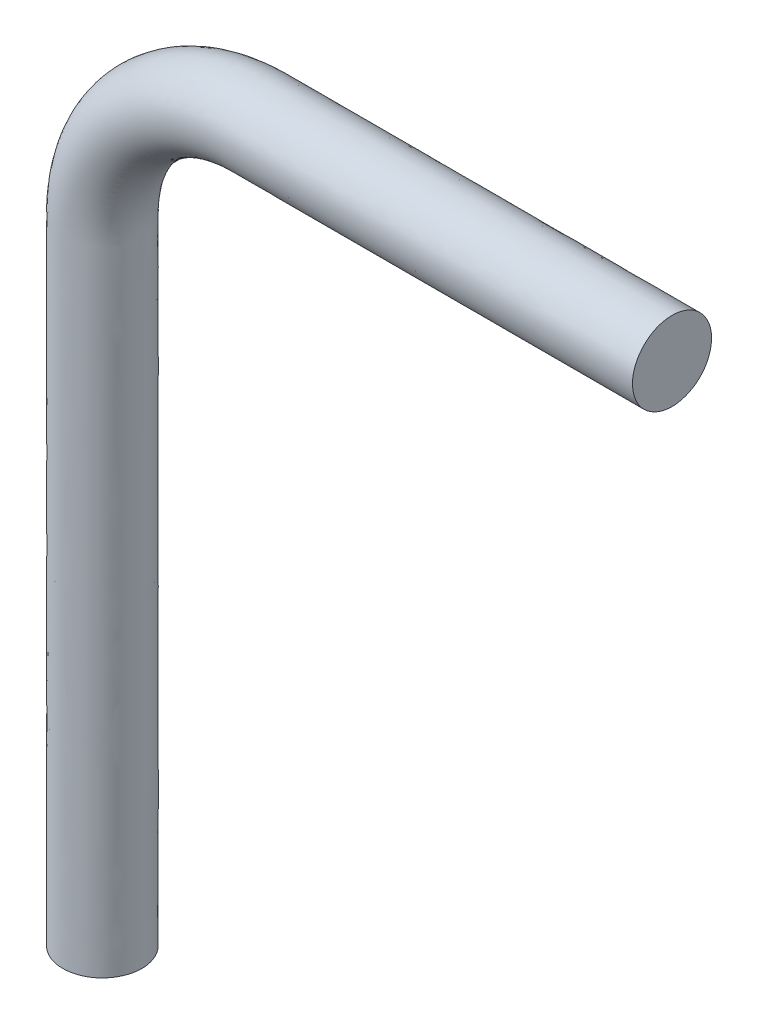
ISO-10303-21;
HEADER;
FILE_DESCRIPTION(('STEP AP214'),'2;1');
FILE_NAME('part.step','',(''),(''),'','','');
FILE_SCHEMA(('AUTOMOTIVE_DESIGN { 1 0 10303 214 1 1 1 1 }'));
ENDSEC;
DATA;
#1=APPLICATION_CONTEXT('core data for automotive mechanical design processes');
#2=APPLICATION_PROTOCOL_DEFINITION('international standard','automotive_design',2000,#1);
#3=PRODUCT_CONTEXT('',#1,'mechanical');
#4=PRODUCT('Part','Part','',(#3));
#5=PRODUCT_RELATED_PRODUCT_CATEGORY('part','',(#4));
#6=PRODUCT_DEFINITION_FORMATION('','',#4);
#7=PRODUCT_DEFINITION_CONTEXT('part definition',#1,'design');
#8=PRODUCT_DEFINITION('design','',#6,#7);
#9=PRODUCT_DEFINITION_SHAPE('','',#8);
#10=(LENGTH_UNIT() NAMED_UNIT(*) SI_UNIT(.MILLI.,.METRE.));
#11=(NAMED_UNIT(*) PLANE_ANGLE_UNIT() SI_UNIT($,.RADIAN.));
#12=(NAMED_UNIT(*) SI_UNIT($,.STERADIAN.) SOLID_ANGLE_UNIT());
#13=UNCERTAINTY_MEASURE_WITH_UNIT(LENGTH_MEASURE(1.E-05),#10,'distance_accuracy_value','');
#14=(GEOMETRIC_REPRESENTATION_CONTEXT(3) GLOBAL_UNCERTAINTY_ASSIGNED_CONTEXT((#13)) GLOBAL_UNIT_ASSIGNED_CONTEXT((#10,
#11,#12)) REPRESENTATION_CONTEXT('',''));
#15=CARTESIAN_POINT('',(0.,0.,0.));
#16=DIRECTION('',(0.,0.,1.));
#17=DIRECTION('',(1.,0.,0.));
#18=AXIS2_PLACEMENT_3D('',#15,#16,#17);
#19=CARTESIAN_POINT('',(0.,-126.867609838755,0.));
#20=DIRECTION('',(1.,0.,0.));
#21=DIRECTION('',(0.,0.,-1.));
#22=AXIS2_PLACEMENT_3D('',#19,#20,#21);
#23=PLANE('',#22);
#24=CARTESIAN_POINT('',(0.,-131.8375,0.));
#25=CARTESIAN_POINT('',(0.,-131.8375,0.741304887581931));
#26=CARTESIAN_POINT('',(0.,-131.123512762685,2.22391466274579));
#27=CARTESIAN_POINT('',(0.,-128.717040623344,2.77317622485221));
#28=CARTESIAN_POINT('',(0.,-126.787199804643,1.23417952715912));
#29=CARTESIAN_POINT('',(0.,-126.787199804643,-1.23417952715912));
#30=CARTESIAN_POINT('',(0.,-128.717040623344,-2.77317622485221));
#31=CARTESIAN_POINT('',(0.,-131.123512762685,-2.22391466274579));
#32=CARTESIAN_POINT('',(0.,-131.8375,-0.741304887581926));
#33=CARTESIAN_POINT('',(0.,-131.8375,0.));
#34=B_SPLINE_CURVE_WITH_KNOTS('',3,(#24,#25,#26,#27,#28,#29,#30,#31,#32,#33),.UNSPECIFIED.,.T.,
.F.,(4,1,1,1,1,1,1,4),(0.,0.142857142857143,0.285714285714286,0.428571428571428,
0.571428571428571,0.714285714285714,0.857142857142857,1.),.UNSPECIFIED.);
#35=CARTESIAN_POINT('',(0.,-131.8375,0.));
#36=VERTEX_POINT('',#35);
#37=EDGE_CURVE('E24',#36,#36,#34,.T.);
#38=ORIENTED_EDGE('',*,*,#37,.F.);
#39=EDGE_LOOP('',(#38));
#40=FACE_BOUND('',#39,.T.);
#41=ADVANCED_FACE('F14',(#40),#23,.T.);
#42=CARTESIAN_POINT('',(-38.3023901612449,-179.1,0.));
#43=DIRECTION('',(0.,1.,0.));
#44=DIRECTION('',(0.,0.,1.));
#45=AXIS2_PLACEMENT_3D('',#42,#43,#44);
#46=PLANE('',#45);
#47=CARTESIAN_POINT('',(-33.3325,-179.1,0.));
#48=CARTESIAN_POINT('',(-33.3325,-179.1,0.741304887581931));
#49=CARTESIAN_POINT('',(-34.0464872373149,-179.1,2.22391466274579));
#50=CARTESIAN_POINT('',(-36.4529593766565,-179.1,2.77317622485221));
#51=CARTESIAN_POINT('',(-38.3828001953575,-179.1,1.23417952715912));
#52=CARTESIAN_POINT('',(-38.3828001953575,-179.1,-1.23417952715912));
#53=CARTESIAN_POINT('',(-36.4529593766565,-179.1,-2.77317622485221));
#54=CARTESIAN_POINT('',(-34.0464872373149,-179.1,-2.22391466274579));
#55=CARTESIAN_POINT('',(-33.3325,-179.1,-0.741304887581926));
#56=CARTESIAN_POINT('',(-33.3325,-179.1,0.));
#57=B_SPLINE_CURVE_WITH_KNOTS('',3,(#47,#48,#49,#50,#51,#52,#53,#54,#55,#56),.UNSPECIFIED.,.T.,
.F.,(4,1,1,1,1,1,1,4),(0.,0.142857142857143,0.285714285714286,0.428571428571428,
0.571428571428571,0.714285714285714,0.857142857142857,1.),.UNSPECIFIED.);
#58=CARTESIAN_POINT('',(-33.3325,-179.1,0.));
#59=VERTEX_POINT('',#58);
#60=EDGE_CURVE('E10',#59,#59,#57,.F.);
#61=ORIENTED_EDGE('',*,*,#60,.F.);
#62=EDGE_LOOP('',(#61));
#63=FACE_BOUND('',#62,.T.);
#64=ADVANCED_FACE('F16',(#63),#46,.F.);
#65=CARTESIAN_POINT('',(0.,-131.8375,0.));
#66=CARTESIAN_POINT('',(-8.62333333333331,-131.8375,0.));
#67=CARTESIAN_POINT('',(-17.2466666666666,-131.8375,0.));
#68=CARTESIAN_POINT('',(-25.87,-131.8375,0.));
#69=CARTESIAN_POINT('',(-26.8424136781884,-131.8375,0.));
#70=CARTESIAN_POINT('',(-28.802116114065,-132.225905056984,0.));
#71=CARTESIAN_POINT('',(-31.2836237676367,-133.886376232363,0.));
#72=CARTESIAN_POINT('',(-32.9440949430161,-136.367883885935,0.));
#73=CARTESIAN_POINT('',(-33.3325,-138.327586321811,0.));
#74=CARTESIAN_POINT('',(-33.3325,-139.3,0.));
#75=CARTESIAN_POINT('',(-33.3325,-152.566666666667,0.));
#76=CARTESIAN_POINT('',(-33.3325,-165.833333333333,0.));
#77=CARTESIAN_POINT('',(-33.3325,-179.1,0.));
#78=CARTESIAN_POINT('',(0.,-131.8375,0.741304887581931));
#79=CARTESIAN_POINT('',(-8.62333333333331,-131.8375,0.741304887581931));
#80=CARTESIAN_POINT('',(-17.2466666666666,-131.8375,0.741304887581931));
#81=CARTESIAN_POINT('',(-25.87,-131.8375,0.741304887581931));
#82=CARTESIAN_POINT('',(-26.8424136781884,-131.8375,0.741304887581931));
#83=CARTESIAN_POINT('',(-28.802116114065,-132.225905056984,0.741304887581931));
#84=CARTESIAN_POINT('',(-31.2836237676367,-133.886376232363,0.741304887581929));
#85=CARTESIAN_POINT('',(-32.9440949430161,-136.367883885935,0.741304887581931));
#86=CARTESIAN_POINT('',(-33.3325,-138.327586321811,0.741304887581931));
#87=CARTESIAN_POINT('',(-33.3325,-139.3,0.741304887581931));
#88=CARTESIAN_POINT('',(-33.3325,-152.566666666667,0.741304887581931));
#89=CARTESIAN_POINT('',(-33.3325,-165.833333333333,0.741304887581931));
#90=CARTESIAN_POINT('',(-33.3325,-179.1,0.741304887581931));
#91=CARTESIAN_POINT('',(0.,-131.123512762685,2.22391466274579));
#92=CARTESIAN_POINT('',(-8.62333333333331,-131.123512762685,2.22391466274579));
#93=CARTESIAN_POINT('',(-17.2466666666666,-131.123512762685,2.22391466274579));
#94=CARTESIAN_POINT('',(-25.87,-131.123512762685,2.22391466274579));
#95=CARTESIAN_POINT('',(-26.9370942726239,-131.123512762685,2.22391466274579));
#96=CARTESIAN_POINT('',(-29.0818883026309,-131.549137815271,2.22391466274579));
#97=CARTESIAN_POINT('',(-31.8017867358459,-133.368213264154,2.22391466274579));
#98=CARTESIAN_POINT('',(-33.620862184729,-136.088111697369,2.22391466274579));
#99=CARTESIAN_POINT('',(-34.0464872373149,-138.232905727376,2.22391466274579));
#100=CARTESIAN_POINT('',(-34.0464872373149,-139.3,2.22391466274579));
#101=CARTESIAN_POINT('',(-34.0464872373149,-152.566666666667,2.22391466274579));
#102=CARTESIAN_POINT('',(-34.0464872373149,-165.833333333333,2.22391466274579));
#103=CARTESIAN_POINT('',(-34.0464872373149,-179.1,2.22391466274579));
#104=CARTESIAN_POINT('',(0.,-128.717040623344,2.77317622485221));
#105=CARTESIAN_POINT('',(-8.62333333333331,-128.717040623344,2.77317622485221));
#106=CARTESIAN_POINT('',(-17.2466666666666,-128.717040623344,2.77317622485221));
#107=CARTESIAN_POINT('',(-25.87,-128.717040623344,2.77317622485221));
#108=CARTESIAN_POINT('',(-27.2562123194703,-128.717040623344,2.77317622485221));
#109=CARTESIAN_POINT('',(-30.0248519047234,-129.268114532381,2.77317622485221));
#110=CARTESIAN_POINT('',(-33.5482391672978,-131.621760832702,2.77317622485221));
#111=CARTESIAN_POINT('',(-35.9018854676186,-135.145148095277,2.77317622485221));
#112=CARTESIAN_POINT('',(-36.4529593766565,-137.91378768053,2.77317622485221));
#113=CARTESIAN_POINT('',(-36.4529593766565,-139.3,2.77317622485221));
#114=CARTESIAN_POINT('',(-36.4529593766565,-152.566666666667,2.77317622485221));
#115=CARTESIAN_POINT('',(-36.4529593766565,-165.833333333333,2.77317622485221));
#116=CARTESIAN_POINT('',(-36.4529593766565,-179.1,2.77317622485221));
#117=CARTESIAN_POINT('',(0.,-126.787199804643,1.23417952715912));
#118=CARTESIAN_POINT('',(-8.62333333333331,-126.787199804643,1.23417952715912));
#119=CARTESIAN_POINT('',(-17.2466666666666,-126.787199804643,1.23417952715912));
#120=CARTESIAN_POINT('',(-25.87,-126.787199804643,1.23417952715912));
#121=CARTESIAN_POINT('',(-27.5121251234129,-126.787199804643,1.23417952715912));
#122=CARTESIAN_POINT('',(-30.7810500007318,-127.438875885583,1.23417952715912));
#123=CARTESIAN_POINT('',(-34.9487852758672,-130.221214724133,1.23417952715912));
#124=CARTESIAN_POINT('',(-37.7311241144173,-134.388949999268,1.23417952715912));
#125=CARTESIAN_POINT('',(-38.3828001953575,-137.657874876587,1.23417952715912));
#126=CARTESIAN_POINT('',(-38.3828001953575,-139.3,1.23417952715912));
#127=CARTESIAN_POINT('',(-38.3828001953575,-152.566666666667,1.23417952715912));
#128=CARTESIAN_POINT('',(-38.3828001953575,-165.833333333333,1.23417952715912));
#129=CARTESIAN_POINT('',(-38.3828001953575,-179.1,1.23417952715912));
#130=CARTESIAN_POINT('',(0.,-126.787199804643,-1.23417952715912));
#131=CARTESIAN_POINT('',(-8.62333333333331,-126.787199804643,-1.23417952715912));
#132=CARTESIAN_POINT('',(-17.2466666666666,-126.787199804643,-1.23417952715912));
#133=CARTESIAN_POINT('',(-25.87,-126.787199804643,-1.23417952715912));
#134=CARTESIAN_POINT('',(-27.5121251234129,-126.787199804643,-1.23417952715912));
#135=CARTESIAN_POINT('',(-30.7810500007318,-127.438875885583,-1.23417952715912));
#136=CARTESIAN_POINT('',(-34.9487852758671,-130.221214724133,-1.23417952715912));
#137=CARTESIAN_POINT('',(-37.7311241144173,-134.388949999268,-1.23417952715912));
#138=CARTESIAN_POINT('',(-38.3828001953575,-137.657874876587,-1.23417952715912));
#139=CARTESIAN_POINT('',(-38.3828001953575,-139.3,-1.23417952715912));
#140=CARTESIAN_POINT('',(-38.3828001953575,-152.566666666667,-1.23417952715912));
#141=CARTESIAN_POINT('',(-38.3828001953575,-165.833333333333,-1.23417952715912));
#142=CARTESIAN_POINT('',(-38.3828001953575,-179.1,-1.23417952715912));
#143=CARTESIAN_POINT('',(0.,-128.717040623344,-2.77317622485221));
#144=CARTESIAN_POINT('',(-8.62333333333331,-128.717040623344,-2.77317622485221));
#145=CARTESIAN_POINT('',(-17.2466666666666,-128.717040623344,-2.77317622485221));
#146=CARTESIAN_POINT('',(-25.87,-128.717040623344,-2.77317622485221));
#147=CARTESIAN_POINT('',(-27.2562123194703,-128.717040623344,-2.77317622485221));
#148=CARTESIAN_POINT('',(-30.0248519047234,-129.268114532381,-2.77317622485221));
#149=CARTESIAN_POINT('',(-33.5482391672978,-131.621760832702,-2.77317622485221));
#150=CARTESIAN_POINT('',(-35.9018854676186,-135.145148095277,-2.77317622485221));
#151=CARTESIAN_POINT('',(-36.4529593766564,-137.91378768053,-2.77317622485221));
#152=CARTESIAN_POINT('',(-36.4529593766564,-139.3,-2.77317622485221));
#153=CARTESIAN_POINT('',(-36.4529593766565,-152.566666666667,-2.77317622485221));
#154=CARTESIAN_POINT('',(-36.4529593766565,-165.833333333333,-2.77317622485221));
#155=CARTESIAN_POINT('',(-36.4529593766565,-179.1,-2.77317622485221));
#156=CARTESIAN_POINT('',(0.,-131.123512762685,-2.22391466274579));
#157=CARTESIAN_POINT('',(-8.62333333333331,-131.123512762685,-2.22391466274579));
#158=CARTESIAN_POINT('',(-17.2466666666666,-131.123512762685,-2.22391466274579));
#159=CARTESIAN_POINT('',(-25.87,-131.123512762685,-2.22391466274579));
#160=CARTESIAN_POINT('',(-26.9370942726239,-131.123512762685,-2.22391466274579));
#161=CARTESIAN_POINT('',(-29.0818883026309,-131.549137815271,-2.22391466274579));
#162=CARTESIAN_POINT('',(-31.8017867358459,-133.368213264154,-2.22391466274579));
#163=CARTESIAN_POINT('',(-33.620862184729,-136.088111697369,-2.22391466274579));
#164=CARTESIAN_POINT('',(-34.0464872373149,-138.232905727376,-2.22391466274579));
#165=CARTESIAN_POINT('',(-34.0464872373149,-139.3,-2.22391466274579));
#166=CARTESIAN_POINT('',(-34.0464872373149,-152.566666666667,-2.22391466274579));
#167=CARTESIAN_POINT('',(-34.0464872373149,-165.833333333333,-2.22391466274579));
#168=CARTESIAN_POINT('',(-34.0464872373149,-179.1,-2.22391466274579));
#169=CARTESIAN_POINT('',(0.,-131.8375,-0.741304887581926));
#170=CARTESIAN_POINT('',(-8.62333333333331,-131.8375,-0.741304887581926));
#171=CARTESIAN_POINT('',(-17.2466666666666,-131.8375,-0.741304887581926));
#172=CARTESIAN_POINT('',(-25.87,-131.8375,-0.741304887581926));
#173=CARTESIAN_POINT('',(-26.8424136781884,-131.8375,-0.741304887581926));
#174=CARTESIAN_POINT('',(-28.802116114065,-132.225905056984,-0.741304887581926));
#175=CARTESIAN_POINT('',(-31.2836237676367,-133.886376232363,-0.741304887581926));
#176=CARTESIAN_POINT('',(-32.9440949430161,-136.367883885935,-0.741304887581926));
#177=CARTESIAN_POINT('',(-33.3325,-138.327586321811,-0.741304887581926));
#178=CARTESIAN_POINT('',(-33.3325,-139.3,-0.741304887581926));
#179=CARTESIAN_POINT('',(-33.3325,-152.566666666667,-0.741304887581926));
#180=CARTESIAN_POINT('',(-33.3325,-165.833333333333,-0.741304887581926));
#181=CARTESIAN_POINT('',(-33.3325,-179.1,-0.741304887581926));
#182=CARTESIAN_POINT('',(0.,-131.8375,0.));
#183=CARTESIAN_POINT('',(-8.62333333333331,-131.8375,0.));
#184=CARTESIAN_POINT('',(-17.2466666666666,-131.8375,0.));
#185=CARTESIAN_POINT('',(-25.87,-131.8375,0.));
#186=CARTESIAN_POINT('',(-26.8424136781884,-131.8375,0.));
#187=CARTESIAN_POINT('',(-28.802116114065,-132.225905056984,0.));
#188=CARTESIAN_POINT('',(-31.2836237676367,-133.886376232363,0.));
#189=CARTESIAN_POINT('',(-32.9440949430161,-136.367883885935,0.));
#190=CARTESIAN_POINT('',(-33.3325,-138.327586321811,0.));
#191=CARTESIAN_POINT('',(-33.3325,-139.3,0.));
#192=CARTESIAN_POINT('',(-33.3325,-152.566666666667,0.));
#193=CARTESIAN_POINT('',(-33.3325,-165.833333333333,0.));
#194=CARTESIAN_POINT('',(-33.3325,-179.1,0.));
#195=B_SPLINE_SURFACE_WITH_KNOTS('',3,3,((#65,#66,#67,#68,#69,#70,#71,#72,#73,#74,#75,#76,#77),
(#78,#79,#80,#81,#82,#83,#84,#85,#86,#87,#88,#89,#90),(#91,#92,#93,#94,#95,#96,#97,#98,#99,#100,
#101,#102,#103),(#104,#105,#106,#107,#108,#109,#110,#111,#112,#113,#114,#115,#116),(#117,#118,
#119,#120,#121,#122,#123,#124,#125,#126,#127,#128,#129),(#130,#131,#132,#133,#134,#135,#136,
#137,#138,#139,#140,#141,#142),(#143,#144,#145,#146,#147,#148,#149,#150,#151,#152,#153,#154,
#155),(#156,#157,#158,#159,#160,#161,#162,#163,#164,#165,#166,#167,#168),(#169,#170,#171,#172,
#173,#174,#175,#176,#177,#178,#179,#180,#181),(#182,#183,#184,#185,#186,#187,#188,#189,#190,
#191,#192,#193,#194)),.UNSPECIFIED.,.T.,.F.,.F.,(4,1,1,1,1,1,1,4),(4,3,1,1,1,3,4),(0.,
0.142857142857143,0.285714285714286,0.428571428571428,0.571428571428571,0.714285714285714,
0.857142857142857,1.),(0.,1.,2.,3.,4.,5.,6.),.UNSPECIFIED.);
#196=ORIENTED_EDGE('',*,*,#37,.T.);
#197=EDGE_LOOP('',(#196));
#198=FACE_BOUND('',#197,.T.);
#199=ORIENTED_EDGE('',*,*,#60,.T.);
#200=EDGE_LOOP('',(#199));
#201=FACE_BOUND('',#200,.T.);
#202=ADVANCED_FACE('F53',(#198,#201),#195,.T.);
#203=CLOSED_SHELL('',(#41,#64,#202));
#204=MANIFOLD_SOLID_BREP('B1',#203);
#205=ADVANCED_BREP_SHAPE_REPRESENTATION('',(#18,#204),#14);
#206=SHAPE_DEFINITION_REPRESENTATION(#9,#205);
ENDSEC;
END-ISO-10303-21;
